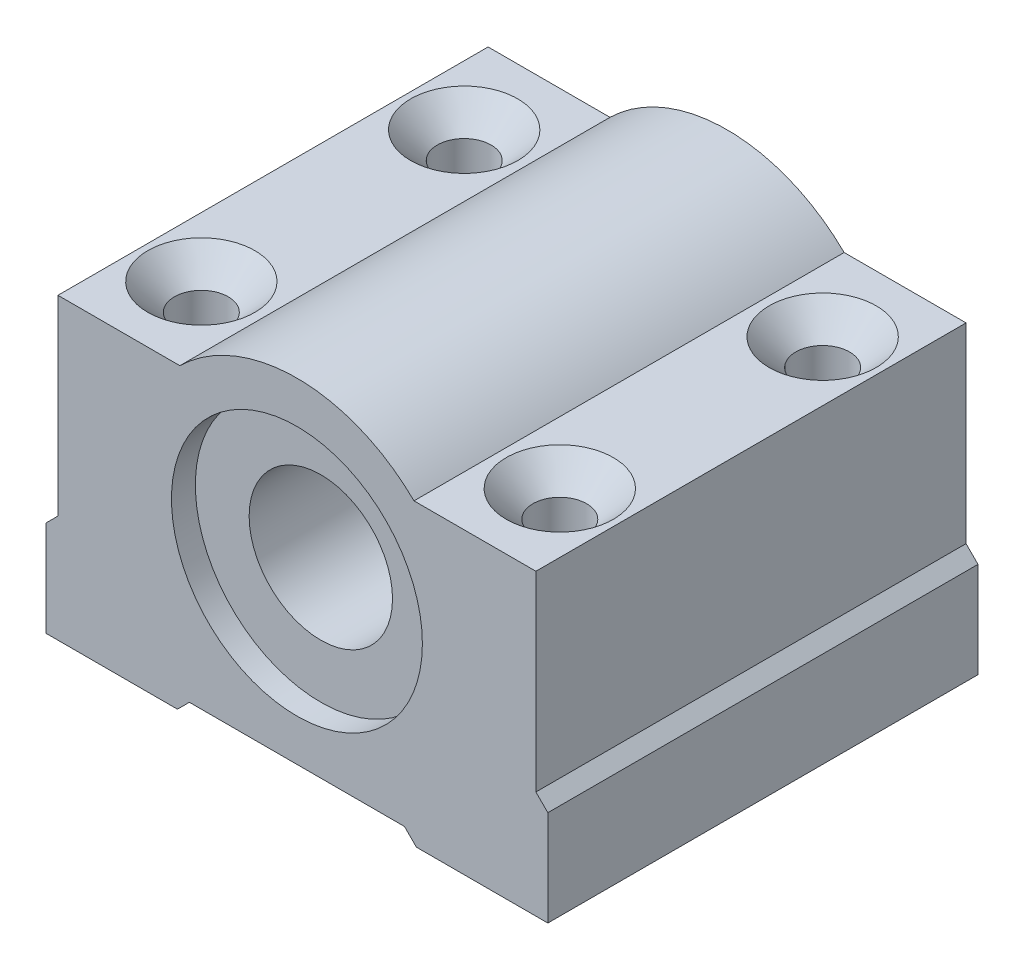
ISO-10303-21;
HEADER;
FILE_DESCRIPTION(('STEP AP214'),'2;1');
FILE_NAME('part.step','',(''),(''),'','','');
FILE_SCHEMA(('AUTOMOTIVE_DESIGN { 1 0 10303 214 1 1 1 1 }'));
ENDSEC;
DATA;
#1=APPLICATION_CONTEXT('core data for automotive mechanical design processes');
#2=APPLICATION_PROTOCOL_DEFINITION('international standard','automotive_design',2000,#1);
#3=PRODUCT_CONTEXT('',#1,'mechanical');
#4=PRODUCT('Part','Part','',(#3));
#5=PRODUCT_RELATED_PRODUCT_CATEGORY('part','',(#4));
#6=PRODUCT_DEFINITION_FORMATION('','',#4);
#7=PRODUCT_DEFINITION_CONTEXT('part definition',#1,'design');
#8=PRODUCT_DEFINITION('design','',#6,#7);
#9=PRODUCT_DEFINITION_SHAPE('','',#8);
#10=(LENGTH_UNIT() NAMED_UNIT(*) SI_UNIT(.MILLI.,.METRE.));
#11=(NAMED_UNIT(*) PLANE_ANGLE_UNIT() SI_UNIT($,.RADIAN.));
#12=(NAMED_UNIT(*) SI_UNIT($,.STERADIAN.) SOLID_ANGLE_UNIT());
#13=UNCERTAINTY_MEASURE_WITH_UNIT(LENGTH_MEASURE(1.E-05),#10,'distance_accuracy_value','');
#14=(GEOMETRIC_REPRESENTATION_CONTEXT(3) GLOBAL_UNCERTAINTY_ASSIGNED_CONTEXT((#13)) GLOBAL_UNIT_ASSIGNED_CONTEXT((#10,
#11,#12)) REPRESENTATION_CONTEXT('',''));
#15=CARTESIAN_POINT('',(0.,0.,0.));
#16=DIRECTION('',(0.,0.,1.));
#17=DIRECTION('',(1.,0.,0.));
#18=AXIS2_PLACEMENT_3D('',#15,#16,#17);
#19=CARTESIAN_POINT('',(21.,15.,18.));
#20=DIRECTION('',(0.,0.,-1.));
#21=DIRECTION('',(-1.,0.,0.));
#22=AXIS2_PLACEMENT_3D('',#19,#20,#21);
#23=CYLINDRICAL_SURFACE('',#22,6.);
#24=CARTESIAN_POINT('',(21.,15.,16.));
#25=DIRECTION('',(0.,0.,1.));
#26=DIRECTION('',(1.,0.,0.));
#27=AXIS2_PLACEMENT_3D('',#24,#25,#26);
#28=CIRCLE('',#27,6.);
#29=CARTESIAN_POINT('',(27.,15.,16.));
#30=VERTEX_POINT('',#29);
#31=EDGE_CURVE('E177',#30,#30,#28,.T.);
#32=ORIENTED_EDGE('',*,*,#31,.T.);
#33=EDGE_LOOP('',(#32));
#34=FACE_BOUND('',#33,.T.);
#35=CARTESIAN_POINT('',(21.,15.,-16.));
#36=DIRECTION('',(0.,0.,-1.));
#37=DIRECTION('',(-1.,0.,0.));
#38=AXIS2_PLACEMENT_3D('',#35,#36,#37);
#39=CIRCLE('',#38,6.);
#40=CARTESIAN_POINT('',(15.,15.,-16.));
#41=VERTEX_POINT('',#40);
#42=EDGE_CURVE('E42',#41,#41,#39,.T.);
#43=ORIENTED_EDGE('',*,*,#42,.T.);
#44=EDGE_LOOP('',(#43));
#45=FACE_BOUND('',#44,.T.);
#46=ADVANCED_FACE('F38',(#34,#45),#23,.F.);
#47=CARTESIAN_POINT('',(21.,15.,18.));
#48=DIRECTION('',(0.,0.,1.));
#49=DIRECTION('',(1.,0.,0.));
#50=AXIS2_PLACEMENT_3D('',#47,#48,#49);
#51=PLANE('',#50);
#52=CARTESIAN_POINT('',(21.,15.,18.));
#53=DIRECTION('',(0.,0.,1.));
#54=DIRECTION('',(1.,0.,0.));
#55=AXIS2_PLACEMENT_3D('',#52,#53,#54);
#56=CIRCLE('',#55,10.5);
#57=CARTESIAN_POINT('',(31.5,15.,18.));
#58=VERTEX_POINT('',#57);
#59=EDGE_CURVE('E234',#58,#58,#56,.T.);
#60=ORIENTED_EDGE('',*,*,#59,.F.);
#61=EDGE_LOOP('',(#60));
#62=FACE_BOUND('',#61,.T.);
#63=DIRECTION('',(1.,0.,0.));
#64=VECTOR('',#63,1.);
#65=CARTESIAN_POINT('',(11.,0.,18.));
#66=LINE('',#65,#64);
#67=CARTESIAN_POINT('',(0.,0.,18.));
#68=VERTEX_POINT('',#67);
#69=CARTESIAN_POINT('',(11.,0.,18.));
#70=VERTEX_POINT('',#69);
#71=EDGE_CURVE('E200',#68,#70,#66,.T.);
#72=ORIENTED_EDGE('',*,*,#71,.T.);
#73=DIRECTION('',(0.707106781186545,0.707106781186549,0.));
#74=VECTOR('',#73,1.);
#75=CARTESIAN_POINT('',(12.,0.999999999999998,18.));
#76=LINE('',#75,#74);
#77=CARTESIAN_POINT('',(12.,0.999999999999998,18.));
#78=VERTEX_POINT('',#77);
#79=EDGE_CURVE('E118',#70,#78,#76,.T.);
#80=ORIENTED_EDGE('',*,*,#79,.T.);
#81=DIRECTION('',(1.,0.,0.));
#82=VECTOR('',#81,1.);
#83=CARTESIAN_POINT('',(30.,1.,18.));
#84=LINE('',#83,#82);
#85=CARTESIAN_POINT('',(30.,1.,18.));
#86=VERTEX_POINT('',#85);
#87=EDGE_CURVE('E246',#78,#86,#84,.T.);
#88=ORIENTED_EDGE('',*,*,#87,.T.);
#89=DIRECTION('',(0.707106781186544,-0.707106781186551,0.));
#90=VECTOR('',#89,1.);
#91=CARTESIAN_POINT('',(31.,0.,18.));
#92=LINE('',#91,#90);
#93=CARTESIAN_POINT('',(31.,0.,18.));
#94=VERTEX_POINT('',#93);
#95=EDGE_CURVE('E248',#86,#94,#92,.T.);
#96=ORIENTED_EDGE('',*,*,#95,.T.);
#97=DIRECTION('',(1.,0.,0.));
#98=VECTOR('',#97,1.);
#99=CARTESIAN_POINT('',(42.,0.,18.));
#100=LINE('',#99,#98);
#101=CARTESIAN_POINT('',(42.,0.,18.));
#102=VERTEX_POINT('',#101);
#103=EDGE_CURVE('E250',#94,#102,#100,.T.);
#104=ORIENTED_EDGE('',*,*,#103,.T.);
#105=DIRECTION('',(0.,1.,0.));
#106=VECTOR('',#105,1.);
#107=CARTESIAN_POINT('',(42.,8.,18.));
#108=LINE('',#107,#106);
#109=CARTESIAN_POINT('',(42.,8.,18.));
#110=VERTEX_POINT('',#109);
#111=EDGE_CURVE('E252',#102,#110,#108,.T.);
#112=ORIENTED_EDGE('',*,*,#111,.T.);
#113=DIRECTION('',(-0.707106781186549,0.707106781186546,0.));
#114=VECTOR('',#113,1.);
#115=CARTESIAN_POINT('',(41.,9.,18.));
#116=LINE('',#115,#114);
#117=CARTESIAN_POINT('',(41.,9.,18.));
#118=VERTEX_POINT('',#117);
#119=EDGE_CURVE('E254',#110,#118,#116,.T.);
#120=ORIENTED_EDGE('',*,*,#119,.T.);
#121=DIRECTION('',(0.,1.,0.));
#122=VECTOR('',#121,1.);
#123=CARTESIAN_POINT('',(41.,25.,18.));
#124=LINE('',#123,#122);
#125=CARTESIAN_POINT('',(41.,25.,18.));
#126=VERTEX_POINT('',#125);
#127=EDGE_CURVE('E256',#118,#126,#124,.T.);
#128=ORIENTED_EDGE('',*,*,#127,.T.);
#129=DIRECTION('',(-1.,0.,0.));
#130=VECTOR('',#129,1.);
#131=CARTESIAN_POINT('',(30.7979589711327,25.,18.));
#132=LINE('',#131,#130);
#133=CARTESIAN_POINT('',(30.7979589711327,25.,18.));
#134=VERTEX_POINT('',#133);
#135=EDGE_CURVE('E258',#126,#134,#132,.T.);
#136=ORIENTED_EDGE('',*,*,#135,.T.);
#137=CARTESIAN_POINT('',(21.,15.,18.));
#138=DIRECTION('',(0.,0.,1.));
#139=DIRECTION('',(1.,0.,0.));
#140=AXIS2_PLACEMENT_3D('',#137,#138,#139);
#141=CIRCLE('',#140,14.);
#142=CARTESIAN_POINT('',(11.2020410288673,25.,18.));
#143=VERTEX_POINT('',#142);
#144=EDGE_CURVE('E260',#134,#143,#141,.T.);
#145=ORIENTED_EDGE('',*,*,#144,.T.);
#146=DIRECTION('',(-1.,0.,0.));
#147=VECTOR('',#146,1.);
#148=CARTESIAN_POINT('',(1.,25.,18.));
#149=LINE('',#148,#147);
#150=CARTESIAN_POINT('',(1.,25.,18.));
#151=VERTEX_POINT('',#150);
#152=EDGE_CURVE('E155',#143,#151,#149,.T.);
#153=ORIENTED_EDGE('',*,*,#152,.T.);
#154=DIRECTION('',(0.,-1.,0.));
#155=VECTOR('',#154,1.);
#156=CARTESIAN_POINT('',(1.,9.,18.));
#157=LINE('',#156,#155);
#158=CARTESIAN_POINT('',(1.,9.,18.));
#159=VERTEX_POINT('',#158);
#160=EDGE_CURVE('E149',#151,#159,#157,.T.);
#161=ORIENTED_EDGE('',*,*,#160,.T.);
#162=DIRECTION('',(-0.707106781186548,-0.707106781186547,0.));
#163=VECTOR('',#162,1.);
#164=CARTESIAN_POINT('',(0.,8.,18.));
#165=LINE('',#164,#163);
#166=CARTESIAN_POINT('',(0.,8.,18.));
#167=VERTEX_POINT('',#166);
#168=EDGE_CURVE('E153',#159,#167,#165,.T.);
#169=ORIENTED_EDGE('',*,*,#168,.T.);
#170=DIRECTION('',(0.,-1.,0.));
#171=VECTOR('',#170,1.);
#172=CARTESIAN_POINT('',(0.,0.,18.));
#173=LINE('',#172,#171);
#174=EDGE_CURVE('E57',#167,#68,#173,.T.);
#175=ORIENTED_EDGE('',*,*,#174,.T.);
#176=EDGE_LOOP('',(#72,#80,#88,#96,#104,#112,#120,#128,#136,#145,#153,#161,#169,#175));
#177=FACE_BOUND('',#176,.T.);
#178=ADVANCED_FACE('F151',(#62,#177),#51,.T.);
#179=CARTESIAN_POINT('',(21.,15.,-18.));
#180=DIRECTION('',(0.,0.,1.));
#181=DIRECTION('',(1.,0.,0.));
#182=AXIS2_PLACEMENT_3D('',#179,#180,#181);
#183=PLANE('',#182);
#184=CARTESIAN_POINT('',(21.,15.,-18.));
#185=DIRECTION('',(0.,0.,1.));
#186=DIRECTION('',(1.,0.,0.));
#187=AXIS2_PLACEMENT_3D('',#184,#185,#186);
#188=CIRCLE('',#187,10.5);
#189=CARTESIAN_POINT('',(31.5,15.,-18.));
#190=VERTEX_POINT('',#189);
#191=EDGE_CURVE('E241',#190,#190,#188,.T.);
#192=ORIENTED_EDGE('',*,*,#191,.T.);
#193=EDGE_LOOP('',(#192));
#194=FACE_BOUND('',#193,.T.);
#195=DIRECTION('',(1.,0.,0.));
#196=VECTOR('',#195,1.);
#197=CARTESIAN_POINT('',(11.,0.,-18.));
#198=LINE('',#197,#196);
#199=CARTESIAN_POINT('',(0.,0.,-18.));
#200=VERTEX_POINT('',#199);
#201=CARTESIAN_POINT('',(11.,0.,-18.));
#202=VERTEX_POINT('',#201);
#203=EDGE_CURVE('E173',#200,#202,#198,.T.);
#204=ORIENTED_EDGE('',*,*,#203,.F.);
#205=DIRECTION('',(0.,-1.,0.));
#206=VECTOR('',#205,1.);
#207=CARTESIAN_POINT('',(0.,0.,-18.));
#208=LINE('',#207,#206);
#209=CARTESIAN_POINT('',(0.,8.,-18.));
#210=VERTEX_POINT('',#209);
#211=EDGE_CURVE('E110',#210,#200,#208,.T.);
#212=ORIENTED_EDGE('',*,*,#211,.F.);
#213=DIRECTION('',(-0.707106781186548,-0.707106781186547,0.));
#214=VECTOR('',#213,1.);
#215=CARTESIAN_POINT('',(0.,8.,-18.));
#216=LINE('',#215,#214);
#217=CARTESIAN_POINT('',(1.,9.,-18.));
#218=VERTEX_POINT('',#217);
#219=EDGE_CURVE('E104',#218,#210,#216,.T.);
#220=ORIENTED_EDGE('',*,*,#219,.F.);
#221=DIRECTION('',(0.,-1.,0.));
#222=VECTOR('',#221,1.);
#223=CARTESIAN_POINT('',(1.,9.,-18.));
#224=LINE('',#223,#222);
#225=CARTESIAN_POINT('',(1.,25.,-18.));
#226=VERTEX_POINT('',#225);
#227=EDGE_CURVE('E163',#226,#218,#224,.T.);
#228=ORIENTED_EDGE('',*,*,#227,.F.);
#229=DIRECTION('',(-1.,0.,0.));
#230=VECTOR('',#229,1.);
#231=CARTESIAN_POINT('',(1.,25.,-18.));
#232=LINE('',#231,#230);
#233=CARTESIAN_POINT('',(11.2020410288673,25.,-18.));
#234=VERTEX_POINT('',#233);
#235=EDGE_CURVE('E195',#234,#226,#232,.T.);
#236=ORIENTED_EDGE('',*,*,#235,.F.);
#237=CARTESIAN_POINT('',(21.,15.,-18.));
#238=DIRECTION('',(0.,0.,1.));
#239=DIRECTION('',(1.,0.,0.));
#240=AXIS2_PLACEMENT_3D('',#237,#238,#239);
#241=CIRCLE('',#240,14.);
#242=CARTESIAN_POINT('',(30.7979589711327,25.,-18.));
#243=VERTEX_POINT('',#242);
#244=EDGE_CURVE('E193',#243,#234,#241,.T.);
#245=ORIENTED_EDGE('',*,*,#244,.F.);
#246=DIRECTION('',(-1.,0.,0.));
#247=VECTOR('',#246,1.);
#248=CARTESIAN_POINT('',(30.7979589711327,25.,-18.));
#249=LINE('',#248,#247);
#250=CARTESIAN_POINT('',(41.,25.,-18.));
#251=VERTEX_POINT('',#250);
#252=EDGE_CURVE('E191',#251,#243,#249,.T.);
#253=ORIENTED_EDGE('',*,*,#252,.F.);
#254=DIRECTION('',(0.,1.,0.));
#255=VECTOR('',#254,1.);
#256=CARTESIAN_POINT('',(41.,25.,-18.));
#257=LINE('',#256,#255);
#258=CARTESIAN_POINT('',(41.,9.,-18.));
#259=VERTEX_POINT('',#258);
#260=EDGE_CURVE('E189',#259,#251,#257,.T.);
#261=ORIENTED_EDGE('',*,*,#260,.F.);
#262=DIRECTION('',(-0.707106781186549,0.707106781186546,0.));
#263=VECTOR('',#262,1.);
#264=CARTESIAN_POINT('',(41.,9.,-18.));
#265=LINE('',#264,#263);
#266=CARTESIAN_POINT('',(42.,8.,-18.));
#267=VERTEX_POINT('',#266);
#268=EDGE_CURVE('E187',#267,#259,#265,.T.);
#269=ORIENTED_EDGE('',*,*,#268,.F.);
#270=DIRECTION('',(0.,1.,0.));
#271=VECTOR('',#270,1.);
#272=CARTESIAN_POINT('',(42.,8.,-18.));
#273=LINE('',#272,#271);
#274=CARTESIAN_POINT('',(42.,0.,-18.));
#275=VERTEX_POINT('',#274);
#276=EDGE_CURVE('E185',#275,#267,#273,.T.);
#277=ORIENTED_EDGE('',*,*,#276,.F.);
#278=DIRECTION('',(1.,0.,0.));
#279=VECTOR('',#278,1.);
#280=CARTESIAN_POINT('',(42.,0.,-18.));
#281=LINE('',#280,#279);
#282=CARTESIAN_POINT('',(31.,0.,-18.));
#283=VERTEX_POINT('',#282);
#284=EDGE_CURVE('E183',#283,#275,#281,.T.);
#285=ORIENTED_EDGE('',*,*,#284,.F.);
#286=DIRECTION('',(0.707106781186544,-0.707106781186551,0.));
#287=VECTOR('',#286,1.);
#288=CARTESIAN_POINT('',(31.,0.,-18.));
#289=LINE('',#288,#287);
#290=CARTESIAN_POINT('',(30.,1.,-18.));
#291=VERTEX_POINT('',#290);
#292=EDGE_CURVE('E181',#291,#283,#289,.T.);
#293=ORIENTED_EDGE('',*,*,#292,.F.);
#294=DIRECTION('',(1.,0.,0.));
#295=VECTOR('',#294,1.);
#296=CARTESIAN_POINT('',(30.,1.,-18.));
#297=LINE('',#296,#295);
#298=CARTESIAN_POINT('',(12.,0.999999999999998,-18.));
#299=VERTEX_POINT('',#298);
#300=EDGE_CURVE('E179',#299,#291,#297,.T.);
#301=ORIENTED_EDGE('',*,*,#300,.F.);
#302=DIRECTION('',(0.707106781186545,0.707106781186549,0.));
#303=VECTOR('',#302,1.);
#304=CARTESIAN_POINT('',(12.,0.999999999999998,-18.));
#305=LINE('',#304,#303);
#306=EDGE_CURVE('E176',#202,#299,#305,.T.);
#307=ORIENTED_EDGE('',*,*,#306,.F.);
#308=EDGE_LOOP('',(#204,#212,#220,#228,#236,#245,#253,#261,#269,#277,#285,#293,#301,#307));
#309=FACE_BOUND('',#308,.T.);
#310=ADVANCED_FACE('F273',(#194,#309),#183,.F.);
#311=CARTESIAN_POINT('',(11.,0.,18.));
#312=DIRECTION('',(0.,1.,0.));
#313=DIRECTION('',(-1.,0.,0.));
#314=AXIS2_PLACEMENT_3D('',#311,#312,#313);
#315=PLANE('',#314);
#316=CARTESIAN_POINT('',(6.00000000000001,0.,-11.));
#317=DIRECTION('',(0.,1.,0.));
#318=DIRECTION('',(0.,0.,1.));
#319=AXIS2_PLACEMENT_3D('',#316,#317,#318);
#320=CIRCLE('',#319,2.24999999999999);
#321=CARTESIAN_POINT('',(6.00000000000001,0.,-8.75000000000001));
#322=VERTEX_POINT('',#321);
#323=EDGE_CURVE('E342',#322,#322,#320,.T.);
#324=ORIENTED_EDGE('',*,*,#323,.T.);
#325=EDGE_LOOP('',(#324));
#326=FACE_BOUND('',#325,.T.);
#327=CARTESIAN_POINT('',(6.00000000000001,0.,11.));
#328=DIRECTION('',(0.,1.,0.));
#329=DIRECTION('',(0.,0.,1.));
#330=AXIS2_PLACEMENT_3D('',#327,#328,#329);
#331=CIRCLE('',#330,2.24999999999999);
#332=CARTESIAN_POINT('',(6.00000000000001,0.,13.25));
#333=VERTEX_POINT('',#332);
#334=EDGE_CURVE('E324',#333,#333,#331,.T.);
#335=ORIENTED_EDGE('',*,*,#334,.T.);
#336=EDGE_LOOP('',(#335));
#337=FACE_BOUND('',#336,.T.);
#338=ORIENTED_EDGE('',*,*,#203,.T.);
#339=DIRECTION('',(0.,0.,-1.));
#340=VECTOR('',#339,1.);
#341=CARTESIAN_POINT('',(11.,0.,18.));
#342=LINE('',#341,#340);
#343=EDGE_CURVE('E11',#70,#202,#342,.T.);
#344=ORIENTED_EDGE('',*,*,#343,.F.);
#345=ORIENTED_EDGE('',*,*,#71,.F.);
#346=DIRECTION('',(0.,0.,-1.));
#347=VECTOR('',#346,1.);
#348=CARTESIAN_POINT('',(0.,0.,18.));
#349=LINE('',#348,#347);
#350=EDGE_CURVE('E169',#68,#200,#349,.T.);
#351=ORIENTED_EDGE('',*,*,#350,.T.);
#352=EDGE_LOOP('',(#338,#344,#345,#351));
#353=FACE_BOUND('',#352,.T.);
#354=ADVANCED_FACE('F40',(#326,#337,#353),#315,.F.);
#355=CARTESIAN_POINT('',(12.,0.999999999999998,18.));
#356=DIRECTION('',(-0.707106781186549,0.707106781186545,0.));
#357=DIRECTION('',(-0.707106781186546,-0.70710678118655,0.));
#358=AXIS2_PLACEMENT_3D('',#355,#356,#357);
#359=PLANE('',#358);
#360=ORIENTED_EDGE('',*,*,#306,.T.);
#361=DIRECTION('',(0.,0.,-1.));
#362=VECTOR('',#361,1.);
#363=CARTESIAN_POINT('',(12.,0.999999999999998,18.));
#364=LINE('',#363,#362);
#365=EDGE_CURVE('E48',#78,#299,#364,.T.);
#366=ORIENTED_EDGE('',*,*,#365,.F.);
#367=ORIENTED_EDGE('',*,*,#79,.F.);
#368=ORIENTED_EDGE('',*,*,#343,.T.);
#369=EDGE_LOOP('',(#360,#366,#367,#368));
#370=FACE_BOUND('',#369,.T.);
#371=ADVANCED_FACE('F305',(#370),#359,.F.);
#372=CARTESIAN_POINT('',(30.,1.,18.));
#373=DIRECTION('',(0.,1.,0.));
#374=DIRECTION('',(-1.,0.,0.));
#375=AXIS2_PLACEMENT_3D('',#372,#373,#374);
#376=PLANE('',#375);
#377=ORIENTED_EDGE('',*,*,#300,.T.);
#378=DIRECTION('',(0.,0.,-1.));
#379=VECTOR('',#378,1.);
#380=CARTESIAN_POINT('',(30.,1.,18.));
#381=LINE('',#380,#379);
#382=EDGE_CURVE('E225',#86,#291,#381,.T.);
#383=ORIENTED_EDGE('',*,*,#382,.F.);
#384=ORIENTED_EDGE('',*,*,#87,.F.);
#385=ORIENTED_EDGE('',*,*,#365,.T.);
#386=EDGE_LOOP('',(#377,#383,#384,#385));
#387=FACE_BOUND('',#386,.T.);
#388=ADVANCED_FACE('F509',(#387),#376,.F.);
#389=CARTESIAN_POINT('',(31.,0.,18.));
#390=DIRECTION('',(0.707106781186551,0.707106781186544,0.));
#391=DIRECTION('',(-0.707106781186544,0.707106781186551,0.));
#392=AXIS2_PLACEMENT_3D('',#389,#390,#391);
#393=PLANE('',#392);
#394=ORIENTED_EDGE('',*,*,#292,.T.);
#395=DIRECTION('',(0.,0.,-1.));
#396=VECTOR('',#395,1.);
#397=CARTESIAN_POINT('',(31.,0.,18.));
#398=LINE('',#397,#396);
#399=EDGE_CURVE('E222',#94,#283,#398,.T.);
#400=ORIENTED_EDGE('',*,*,#399,.F.);
#401=ORIENTED_EDGE('',*,*,#95,.F.);
#402=ORIENTED_EDGE('',*,*,#382,.T.);
#403=EDGE_LOOP('',(#394,#400,#401,#402));
#404=FACE_BOUND('',#403,.T.);
#405=ADVANCED_FACE('F505',(#404),#393,.F.);
#406=CARTESIAN_POINT('',(42.,0.,18.));
#407=DIRECTION('',(0.,1.,0.));
#408=DIRECTION('',(0.,0.,1.));
#409=AXIS2_PLACEMENT_3D('',#406,#407,#408);
#410=PLANE('',#409);
#411=CARTESIAN_POINT('',(36.,0.,-11.));
#412=DIRECTION('',(0.,1.,0.));
#413=DIRECTION('',(0.,0.,1.));
#414=AXIS2_PLACEMENT_3D('',#411,#412,#413);
#415=CIRCLE('',#414,2.24999999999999);
#416=CARTESIAN_POINT('',(36.,0.,-8.75000000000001));
#417=VERTEX_POINT('',#416);
#418=EDGE_CURVE('E333',#417,#417,#415,.T.);
#419=ORIENTED_EDGE('',*,*,#418,.T.);
#420=EDGE_LOOP('',(#419));
#421=FACE_BOUND('',#420,.T.);
#422=CARTESIAN_POINT('',(36.,0.,11.));
#423=DIRECTION('',(0.,1.,0.));
#424=DIRECTION('',(0.,0.,1.));
#425=AXIS2_PLACEMENT_3D('',#422,#423,#424);
#426=CIRCLE('',#425,2.24999999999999);
#427=CARTESIAN_POINT('',(36.,0.,13.25));
#428=VERTEX_POINT('',#427);
#429=EDGE_CURVE('E311',#428,#428,#426,.T.);
#430=ORIENTED_EDGE('',*,*,#429,.T.);
#431=EDGE_LOOP('',(#430));
#432=FACE_BOUND('',#431,.T.);
#433=ORIENTED_EDGE('',*,*,#284,.T.);
#434=DIRECTION('',(0.,0.,-1.));
#435=VECTOR('',#434,1.);
#436=CARTESIAN_POINT('',(42.,0.,18.));
#437=LINE('',#436,#435);
#438=EDGE_CURVE('E219',#102,#275,#437,.T.);
#439=ORIENTED_EDGE('',*,*,#438,.F.);
#440=ORIENTED_EDGE('',*,*,#103,.F.);
#441=ORIENTED_EDGE('',*,*,#399,.T.);
#442=EDGE_LOOP('',(#433,#439,#440,#441));
#443=FACE_BOUND('',#442,.T.);
#444=ADVANCED_FACE('F500',(#421,#432,#443),#410,.F.);
#445=CARTESIAN_POINT('',(42.,8.,18.));
#446=DIRECTION('',(-1.,0.,0.));
#447=DIRECTION('',(0.,0.,1.));
#448=AXIS2_PLACEMENT_3D('',#445,#446,#447);
#449=PLANE('',#448);
#450=ORIENTED_EDGE('',*,*,#276,.T.);
#451=DIRECTION('',(0.,0.,-1.));
#452=VECTOR('',#451,1.);
#453=CARTESIAN_POINT('',(42.,8.,18.));
#454=LINE('',#453,#452);
#455=EDGE_CURVE('E216',#110,#267,#454,.T.);
#456=ORIENTED_EDGE('',*,*,#455,.F.);
#457=ORIENTED_EDGE('',*,*,#111,.F.);
#458=ORIENTED_EDGE('',*,*,#438,.T.);
#459=EDGE_LOOP('',(#450,#456,#457,#458));
#460=FACE_BOUND('',#459,.T.);
#461=ADVANCED_FACE('F495',(#460),#449,.F.);
#462=CARTESIAN_POINT('',(41.,9.,18.));
#463=DIRECTION('',(-0.707106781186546,-0.707106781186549,0.));
#464=DIRECTION('',(0.707106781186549,-0.707106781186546,0.));
#465=AXIS2_PLACEMENT_3D('',#462,#463,#464);
#466=PLANE('',#465);
#467=ORIENTED_EDGE('',*,*,#268,.T.);
#468=DIRECTION('',(0.,0.,-1.));
#469=VECTOR('',#468,1.);
#470=CARTESIAN_POINT('',(41.,9.,18.));
#471=LINE('',#470,#469);
#472=EDGE_CURVE('E213',#118,#259,#471,.T.);
#473=ORIENTED_EDGE('',*,*,#472,.F.);
#474=ORIENTED_EDGE('',*,*,#119,.F.);
#475=ORIENTED_EDGE('',*,*,#455,.T.);
#476=EDGE_LOOP('',(#467,#473,#474,#475));
#477=FACE_BOUND('',#476,.T.);
#478=ADVANCED_FACE('F491',(#477),#466,.F.);
#479=CARTESIAN_POINT('',(41.,25.,18.));
#480=DIRECTION('',(-1.,0.,0.));
#481=DIRECTION('',(0.,-1.,0.));
#482=AXIS2_PLACEMENT_3D('',#479,#480,#481);
#483=PLANE('',#482);
#484=ORIENTED_EDGE('',*,*,#260,.T.);
#485=DIRECTION('',(0.,0.,-1.));
#486=VECTOR('',#485,1.);
#487=CARTESIAN_POINT('',(41.,25.,18.));
#488=LINE('',#487,#486);
#489=EDGE_CURVE('E210',#126,#251,#488,.T.);
#490=ORIENTED_EDGE('',*,*,#489,.F.);
#491=ORIENTED_EDGE('',*,*,#127,.F.);
#492=ORIENTED_EDGE('',*,*,#472,.T.);
#493=EDGE_LOOP('',(#484,#490,#491,#492));
#494=FACE_BOUND('',#493,.T.);
#495=ADVANCED_FACE('F477',(#494),#483,.F.);
#496=CARTESIAN_POINT('',(30.7979589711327,25.,18.));
#497=DIRECTION('',(0.,-1.,0.));
#498=DIRECTION('',(0.,0.,-1.));
#499=AXIS2_PLACEMENT_3D('',#496,#497,#498);
#500=PLANE('',#499);
#501=CARTESIAN_POINT('',(36.,25.,-11.));
#502=DIRECTION('',(0.,1.,0.));
#503=DIRECTION('',(0.,0.,1.));
#504=AXIS2_PLACEMENT_3D('',#501,#502,#503);
#505=CIRCLE('',#504,4.48);
#506=CARTESIAN_POINT('',(36.,25.,-6.52));
#507=VERTEX_POINT('',#506);
#508=EDGE_CURVE('E339',#507,#507,#505,.T.);
#509=ORIENTED_EDGE('',*,*,#508,.F.);
#510=EDGE_LOOP('',(#509));
#511=FACE_BOUND('',#510,.T.);
#512=CARTESIAN_POINT('',(36.,25.,11.));
#513=DIRECTION('',(0.,1.,0.));
#514=DIRECTION('',(0.,0.,1.));
#515=AXIS2_PLACEMENT_3D('',#512,#513,#514);
#516=CIRCLE('',#515,4.48);
#517=CARTESIAN_POINT('',(36.,25.,15.48));
#518=VERTEX_POINT('',#517);
#519=EDGE_CURVE('E319',#518,#518,#516,.T.);
#520=ORIENTED_EDGE('',*,*,#519,.F.);
#521=EDGE_LOOP('',(#520));
#522=FACE_BOUND('',#521,.T.);
#523=ORIENTED_EDGE('',*,*,#252,.T.);
#524=DIRECTION('',(0.,0.,-1.));
#525=VECTOR('',#524,1.);
#526=CARTESIAN_POINT('',(30.7979589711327,25.,18.));
#527=LINE('',#526,#525);
#528=EDGE_CURVE('E207',#134,#243,#527,.T.);
#529=ORIENTED_EDGE('',*,*,#528,.F.);
#530=ORIENTED_EDGE('',*,*,#135,.F.);
#531=ORIENTED_EDGE('',*,*,#489,.T.);
#532=EDGE_LOOP('',(#523,#529,#530,#531));
#533=FACE_BOUND('',#532,.T.);
#534=ADVANCED_FACE('F474',(#511,#522,#533),#500,.F.);
#535=CARTESIAN_POINT('',(21.,15.,18.));
#536=DIRECTION('',(0.,0.,-1.));
#537=DIRECTION('',(-1.,0.,0.));
#538=AXIS2_PLACEMENT_3D('',#535,#536,#537);
#539=CYLINDRICAL_SURFACE('',#538,14.);
#540=ORIENTED_EDGE('',*,*,#244,.T.);
#541=DIRECTION('',(0.,0.,-1.));
#542=VECTOR('',#541,1.);
#543=CARTESIAN_POINT('',(11.2020410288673,25.,18.));
#544=LINE('',#543,#542);
#545=EDGE_CURVE('E204',#143,#234,#544,.T.);
#546=ORIENTED_EDGE('',*,*,#545,.F.);
#547=ORIENTED_EDGE('',*,*,#144,.F.);
#548=ORIENTED_EDGE('',*,*,#528,.T.);
#549=EDGE_LOOP('',(#540,#546,#547,#548));
#550=FACE_BOUND('',#549,.T.);
#551=ADVANCED_FACE('F266',(#550),#539,.T.);
#552=CARTESIAN_POINT('',(1.,25.,18.));
#553=DIRECTION('',(0.,-1.,0.));
#554=DIRECTION('',(0.,0.,-1.));
#555=AXIS2_PLACEMENT_3D('',#552,#553,#554);
#556=PLANE('',#555);
#557=CARTESIAN_POINT('',(6.00000000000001,25.,-11.));
#558=DIRECTION('',(0.,1.,0.));
#559=DIRECTION('',(0.,0.,1.));
#560=AXIS2_PLACEMENT_3D('',#557,#558,#559);
#561=CIRCLE('',#560,4.48);
#562=CARTESIAN_POINT('',(6.00000000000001,25.,-6.52));
#563=VERTEX_POINT('',#562);
#564=EDGE_CURVE('E348',#563,#563,#561,.T.);
#565=ORIENTED_EDGE('',*,*,#564,.F.);
#566=EDGE_LOOP('',(#565));
#567=FACE_BOUND('',#566,.T.);
#568=CARTESIAN_POINT('',(6.00000000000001,25.,11.));
#569=DIRECTION('',(0.,1.,0.));
#570=DIRECTION('',(0.,0.,1.));
#571=AXIS2_PLACEMENT_3D('',#568,#569,#570);
#572=CIRCLE('',#571,4.48);
#573=CARTESIAN_POINT('',(6.00000000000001,25.,15.48));
#574=VERTEX_POINT('',#573);
#575=EDGE_CURVE('E330',#574,#574,#572,.T.);
#576=ORIENTED_EDGE('',*,*,#575,.F.);
#577=EDGE_LOOP('',(#576));
#578=FACE_BOUND('',#577,.T.);
#579=ORIENTED_EDGE('',*,*,#235,.T.);
#580=DIRECTION('',(0.,0.,-1.));
#581=VECTOR('',#580,1.);
#582=CARTESIAN_POINT('',(1.,25.,18.));
#583=LINE('',#582,#581);
#584=EDGE_CURVE('E164',#151,#226,#583,.T.);
#585=ORIENTED_EDGE('',*,*,#584,.F.);
#586=ORIENTED_EDGE('',*,*,#152,.F.);
#587=ORIENTED_EDGE('',*,*,#545,.T.);
#588=EDGE_LOOP('',(#579,#585,#586,#587));
#589=FACE_BOUND('',#588,.T.);
#590=ADVANCED_FACE('F270',(#567,#578,#589),#556,.F.);
#591=CARTESIAN_POINT('',(1.,9.,18.));
#592=DIRECTION('',(1.,0.,0.));
#593=DIRECTION('',(0.,0.,-1.));
#594=AXIS2_PLACEMENT_3D('',#591,#592,#593);
#595=PLANE('',#594);
#596=ORIENTED_EDGE('',*,*,#227,.T.);
#597=DIRECTION('',(0.,0.,-1.));
#598=VECTOR('',#597,1.);
#599=CARTESIAN_POINT('',(1.,9.,18.));
#600=LINE('',#599,#598);
#601=EDGE_CURVE('E160',#159,#218,#600,.T.);
#602=ORIENTED_EDGE('',*,*,#601,.F.);
#603=ORIENTED_EDGE('',*,*,#160,.F.);
#604=ORIENTED_EDGE('',*,*,#584,.T.);
#605=EDGE_LOOP('',(#596,#602,#603,#604));
#606=FACE_BOUND('',#605,.T.);
#607=ADVANCED_FACE('F161',(#606),#595,.F.);
#608=CARTESIAN_POINT('',(0.,8.,18.));
#609=DIRECTION('',(0.707106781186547,-0.707106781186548,0.));
#610=DIRECTION('',(0.707106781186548,0.707106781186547,0.));
#611=AXIS2_PLACEMENT_3D('',#608,#609,#610);
#612=PLANE('',#611);
#613=ORIENTED_EDGE('',*,*,#219,.T.);
#614=DIRECTION('',(0.,0.,-1.));
#615=VECTOR('',#614,1.);
#616=CARTESIAN_POINT('',(0.,8.,18.));
#617=LINE('',#616,#615);
#618=EDGE_CURVE('E165',#167,#210,#617,.T.);
#619=ORIENTED_EDGE('',*,*,#618,.F.);
#620=ORIENTED_EDGE('',*,*,#168,.F.);
#621=ORIENTED_EDGE('',*,*,#601,.T.);
#622=EDGE_LOOP('',(#613,#619,#620,#621));
#623=FACE_BOUND('',#622,.T.);
#624=ADVANCED_FACE('F167',(#623),#612,.F.);
#625=CARTESIAN_POINT('',(0.,0.,18.));
#626=DIRECTION('',(1.,0.,0.));
#627=DIRECTION('',(0.,0.,-1.));
#628=AXIS2_PLACEMENT_3D('',#625,#626,#627);
#629=PLANE('',#628);
#630=ORIENTED_EDGE('',*,*,#211,.T.);
#631=ORIENTED_EDGE('',*,*,#350,.F.);
#632=ORIENTED_EDGE('',*,*,#174,.F.);
#633=ORIENTED_EDGE('',*,*,#618,.T.);
#634=EDGE_LOOP('',(#630,#631,#632,#633));
#635=FACE_BOUND('',#634,.T.);
#636=ADVANCED_FACE('F278',(#635),#629,.F.);
#637=CARTESIAN_POINT('',(21.,15.,16.));
#638=DIRECTION('',(0.,0.,1.));
#639=DIRECTION('',(1.,0.,0.));
#640=AXIS2_PLACEMENT_3D('',#637,#638,#639);
#641=CYLINDRICAL_SURFACE('',#640,10.5);
#642=CARTESIAN_POINT('',(21.,15.,16.));
#643=DIRECTION('',(0.,0.,1.));
#644=DIRECTION('',(1.,0.,0.));
#645=AXIS2_PLACEMENT_3D('',#642,#643,#644);
#646=CIRCLE('',#645,10.5);
#647=CARTESIAN_POINT('',(31.5,15.,16.));
#648=VERTEX_POINT('',#647);
#649=EDGE_CURVE('E230',#648,#648,#646,.T.);
#650=ORIENTED_EDGE('',*,*,#649,.F.);
#651=EDGE_LOOP('',(#650));
#652=FACE_BOUND('',#651,.T.);
#653=ORIENTED_EDGE('',*,*,#59,.T.);
#654=EDGE_LOOP('',(#653));
#655=FACE_BOUND('',#654,.T.);
#656=ADVANCED_FACE('F280',(#652,#655),#641,.F.);
#657=CARTESIAN_POINT('',(21.,15.,16.));
#658=DIRECTION('',(0.,0.,1.));
#659=DIRECTION('',(1.,0.,0.));
#660=AXIS2_PLACEMENT_3D('',#657,#658,#659);
#661=PLANE('',#660);
#662=ORIENTED_EDGE('',*,*,#31,.F.);
#663=EDGE_LOOP('',(#662));
#664=FACE_BOUND('',#663,.T.);
#665=ORIENTED_EDGE('',*,*,#649,.T.);
#666=EDGE_LOOP('',(#665));
#667=FACE_BOUND('',#666,.T.);
#668=ADVANCED_FACE('F286',(#664,#667),#661,.T.);
#669=CARTESIAN_POINT('',(21.,15.,-16.));
#670=DIRECTION('',(0.,0.,-1.));
#671=DIRECTION('',(-1.,0.,0.));
#672=AXIS2_PLACEMENT_3D('',#669,#670,#671);
#673=CYLINDRICAL_SURFACE('',#672,10.5);
#674=CARTESIAN_POINT('',(21.,15.,-16.));
#675=DIRECTION('',(0.,0.,1.));
#676=DIRECTION('',(1.,0.,0.));
#677=AXIS2_PLACEMENT_3D('',#674,#675,#676);
#678=CIRCLE('',#677,10.5);
#679=CARTESIAN_POINT('',(31.5,15.,-16.));
#680=VERTEX_POINT('',#679);
#681=EDGE_CURVE('E310',#680,#680,#678,.T.);
#682=ORIENTED_EDGE('',*,*,#681,.T.);
#683=EDGE_LOOP('',(#682));
#684=FACE_BOUND('',#683,.T.);
#685=ORIENTED_EDGE('',*,*,#191,.F.);
#686=EDGE_LOOP('',(#685));
#687=FACE_BOUND('',#686,.T.);
#688=ADVANCED_FACE('F388',(#684,#687),#673,.F.);
#689=CARTESIAN_POINT('',(21.,15.,-16.));
#690=DIRECTION('',(0.,0.,-1.));
#691=DIRECTION('',(1.,0.,0.));
#692=AXIS2_PLACEMENT_3D('',#689,#690,#691);
#693=PLANE('',#692);
#694=ORIENTED_EDGE('',*,*,#42,.F.);
#695=EDGE_LOOP('',(#694));
#696=FACE_BOUND('',#695,.T.);
#697=ORIENTED_EDGE('',*,*,#681,.F.);
#698=EDGE_LOOP('',(#697));
#699=FACE_BOUND('',#698,.T.);
#700=ADVANCED_FACE('F384',(#696,#699),#693,.T.);
#701=CARTESIAN_POINT('',(36.,25.,11.));
#702=DIRECTION('',(0.,1.,0.));
#703=DIRECTION('',(0.,0.,1.));
#704=AXIS2_PLACEMENT_3D('',#701,#702,#703);
#705=CYLINDRICAL_SURFACE('',#704,2.24999999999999);
#706=ORIENTED_EDGE('',*,*,#429,.F.);
#707=EDGE_LOOP('',(#706));
#708=FACE_BOUND('',#707,.T.);
#709=CARTESIAN_POINT('',(36.,22.77,11.));
#710=DIRECTION('',(0.,1.,0.));
#711=DIRECTION('',(0.,0.,1.));
#712=AXIS2_PLACEMENT_3D('',#709,#710,#711);
#713=CIRCLE('',#712,2.25);
#714=CARTESIAN_POINT('',(36.,22.77,13.25));
#715=VERTEX_POINT('',#714);
#716=EDGE_CURVE('E314',#715,#715,#713,.T.);
#717=ORIENTED_EDGE('',*,*,#716,.T.);
#718=EDGE_LOOP('',(#717));
#719=FACE_BOUND('',#718,.T.);
#720=ADVANCED_FACE('F380',(#708,#719),#705,.F.);
#721=CARTESIAN_POINT('',(36.,25.,11.));
#722=DIRECTION('',(0.,1.,0.));
#723=DIRECTION('',(0.,0.,1.));
#724=AXIS2_PLACEMENT_3D('',#721,#722,#723);
#725=CONICAL_SURFACE('',#724,4.48,0.78539816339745);
#726=ORIENTED_EDGE('',*,*,#716,.F.);
#727=EDGE_LOOP('',(#726));
#728=FACE_BOUND('',#727,.T.);
#729=ORIENTED_EDGE('',*,*,#519,.T.);
#730=EDGE_LOOP('',(#729));
#731=FACE_BOUND('',#730,.T.);
#732=ADVANCED_FACE('F372',(#728,#731),#725,.F.);
#733=CARTESIAN_POINT('',(6.00000000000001,25.,11.));
#734=DIRECTION('',(0.,1.,0.));
#735=DIRECTION('',(0.,0.,1.));
#736=AXIS2_PLACEMENT_3D('',#733,#734,#735);
#737=CYLINDRICAL_SURFACE('',#736,2.24999999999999);
#738=ORIENTED_EDGE('',*,*,#334,.F.);
#739=EDGE_LOOP('',(#738));
#740=FACE_BOUND('',#739,.T.);
#741=CARTESIAN_POINT('',(6.00000000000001,22.77,11.));
#742=DIRECTION('',(0.,1.,0.));
#743=DIRECTION('',(0.,0.,1.));
#744=AXIS2_PLACEMENT_3D('',#741,#742,#743);
#745=CIRCLE('',#744,2.25);
#746=CARTESIAN_POINT('',(6.00000000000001,22.77,13.25));
#747=VERTEX_POINT('',#746);
#748=EDGE_CURVE('E327',#747,#747,#745,.T.);
#749=ORIENTED_EDGE('',*,*,#748,.T.);
#750=EDGE_LOOP('',(#749));
#751=FACE_BOUND('',#750,.T.);
#752=ADVANCED_FACE('F362',(#740,#751),#737,.F.);
#753=CARTESIAN_POINT('',(6.00000000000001,25.,11.));
#754=DIRECTION('',(0.,1.,0.));
#755=DIRECTION('',(0.,0.,1.));
#756=AXIS2_PLACEMENT_3D('',#753,#754,#755);
#757=CONICAL_SURFACE('',#756,4.48,0.78539816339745);
#758=ORIENTED_EDGE('',*,*,#748,.F.);
#759=EDGE_LOOP('',(#758));
#760=FACE_BOUND('',#759,.T.);
#761=ORIENTED_EDGE('',*,*,#575,.T.);
#762=EDGE_LOOP('',(#761));
#763=FACE_BOUND('',#762,.T.);
#764=ADVANCED_FACE('F359',(#760,#763),#757,.F.);
#765=CARTESIAN_POINT('',(36.,25.,-11.));
#766=DIRECTION('',(0.,1.,0.));
#767=DIRECTION('',(0.,0.,1.));
#768=AXIS2_PLACEMENT_3D('',#765,#766,#767);
#769=CYLINDRICAL_SURFACE('',#768,2.24999999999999);
#770=ORIENTED_EDGE('',*,*,#418,.F.);
#771=EDGE_LOOP('',(#770));
#772=FACE_BOUND('',#771,.T.);
#773=CARTESIAN_POINT('',(36.,22.77,-11.));
#774=DIRECTION('',(0.,1.,0.));
#775=DIRECTION('',(0.,0.,1.));
#776=AXIS2_PLACEMENT_3D('',#773,#774,#775);
#777=CIRCLE('',#776,2.25);
#778=CARTESIAN_POINT('',(36.,22.77,-8.75));
#779=VERTEX_POINT('',#778);
#780=EDGE_CURVE('E336',#779,#779,#777,.T.);
#781=ORIENTED_EDGE('',*,*,#780,.T.);
#782=EDGE_LOOP('',(#781));
#783=FACE_BOUND('',#782,.T.);
#784=ADVANCED_FACE('F361',(#772,#783),#769,.F.);
#785=CARTESIAN_POINT('',(36.,25.,-11.));
#786=DIRECTION('',(0.,1.,0.));
#787=DIRECTION('',(0.,0.,1.));
#788=AXIS2_PLACEMENT_3D('',#785,#786,#787);
#789=CONICAL_SURFACE('',#788,4.48,0.78539816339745);
#790=ORIENTED_EDGE('',*,*,#780,.F.);
#791=EDGE_LOOP('',(#790));
#792=FACE_BOUND('',#791,.T.);
#793=ORIENTED_EDGE('',*,*,#508,.T.);
#794=EDGE_LOOP('',(#793));
#795=FACE_BOUND('',#794,.T.);
#796=ADVANCED_FACE('F369',(#792,#795),#789,.F.);
#797=CARTESIAN_POINT('',(6.00000000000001,25.,-11.));
#798=DIRECTION('',(0.,1.,0.));
#799=DIRECTION('',(0.,0.,1.));
#800=AXIS2_PLACEMENT_3D('',#797,#798,#799);
#801=CYLINDRICAL_SURFACE('',#800,2.24999999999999);
#802=ORIENTED_EDGE('',*,*,#323,.F.);
#803=EDGE_LOOP('',(#802));
#804=FACE_BOUND('',#803,.T.);
#805=CARTESIAN_POINT('',(6.00000000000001,22.77,-11.));
#806=DIRECTION('',(0.,1.,0.));
#807=DIRECTION('',(0.,0.,1.));
#808=AXIS2_PLACEMENT_3D('',#805,#806,#807);
#809=CIRCLE('',#808,2.25);
#810=CARTESIAN_POINT('',(6.00000000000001,22.77,-8.75));
#811=VERTEX_POINT('',#810);
#812=EDGE_CURVE('E345',#811,#811,#809,.T.);
#813=ORIENTED_EDGE('',*,*,#812,.T.);
#814=EDGE_LOOP('',(#813));
#815=FACE_BOUND('',#814,.T.);
#816=ADVANCED_FACE('F442',(#804,#815),#801,.F.);
#817=CARTESIAN_POINT('',(6.00000000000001,25.,-11.));
#818=DIRECTION('',(0.,1.,0.));
#819=DIRECTION('',(0.,0.,1.));
#820=AXIS2_PLACEMENT_3D('',#817,#818,#819);
#821=CONICAL_SURFACE('',#820,4.48,0.78539816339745);
#822=ORIENTED_EDGE('',*,*,#812,.F.);
#823=EDGE_LOOP('',(#822));
#824=FACE_BOUND('',#823,.T.);
#825=ORIENTED_EDGE('',*,*,#564,.T.);
#826=EDGE_LOOP('',(#825));
#827=FACE_BOUND('',#826,.T.);
#828=ADVANCED_FACE('F352',(#824,#827),#821,.F.);
#829=CLOSED_SHELL('',(#46,#178,#310,#354,#371,#388,#405,#444,#461,#478,#495,#534,#551,#590,#607,
#624,#636,#656,#668,#688,#700,#720,#732,#752,#764,#784,#796,#816,#828));
#830=MANIFOLD_SOLID_BREP('B2',#829);
#831=ADVANCED_BREP_SHAPE_REPRESENTATION('',(#18,#830),#14);
#832=SHAPE_DEFINITION_REPRESENTATION(#9,#831);
ENDSEC;
END-ISO-10303-21;
